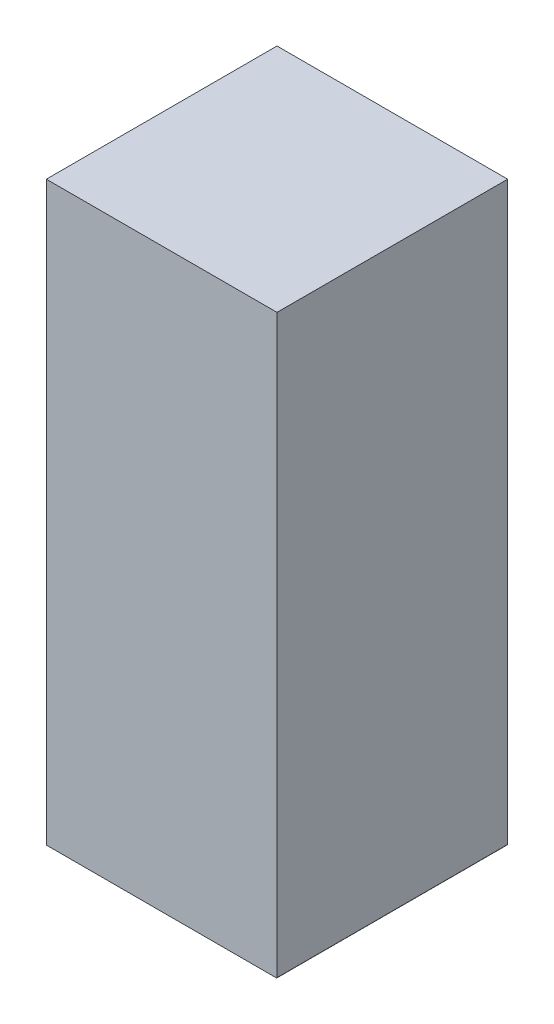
from build123d import *

# Parameters (mm, degrees)
SKETCH1_W           = 800
SKETCH1_H           = 800
BOSS_EXTRUDE1_DEPTH = 2000
FILLET1_R           = 2


with BuildPart() as part:
    # Sketch1 → Boss-Extrude1 (new body)
    with BuildSketch(Plane(origin=(0, 0, 0), x_dir=(1, 0, 0), z_dir=(0, 1, 0))):
        Rectangle(SKETCH1_W, SKETCH1_H)
    extrude(amount=BOSS_EXTRUDE1_DEPTH)

    # Fillet1
    fillet1_edges = [part.edges().sort_by_distance(p)[0] for p in [
        (400, 0, 0),
    ]]
    fillet(fillet1_edges, radius=FILLET1_R)


solid = part.part
